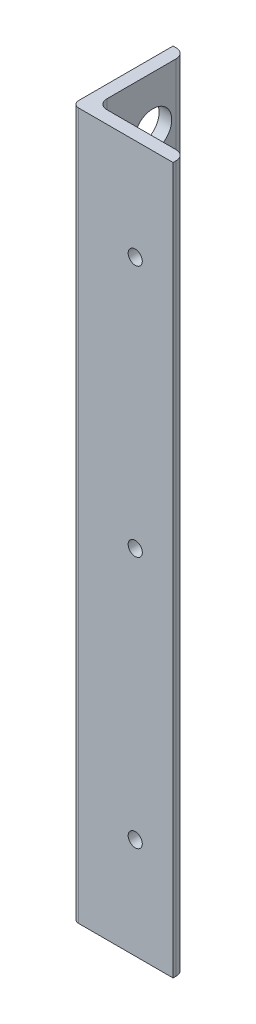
ISO-10303-21;
HEADER;
FILE_DESCRIPTION(('STEP AP214'),'2;1');
FILE_NAME('part.step','',(''),(''),'','','');
FILE_SCHEMA(('AUTOMOTIVE_DESIGN { 1 0 10303 214 1 1 1 1 }'));
ENDSEC;
DATA;
#1=APPLICATION_CONTEXT('core data for automotive mechanical design processes');
#2=APPLICATION_PROTOCOL_DEFINITION('international standard','automotive_design',2000,#1);
#3=PRODUCT_CONTEXT('',#1,'mechanical');
#4=PRODUCT('Part','Part','',(#3));
#5=PRODUCT_RELATED_PRODUCT_CATEGORY('part','',(#4));
#6=PRODUCT_DEFINITION_FORMATION('','',#4);
#7=PRODUCT_DEFINITION_CONTEXT('part definition',#1,'design');
#8=PRODUCT_DEFINITION('design','',#6,#7);
#9=PRODUCT_DEFINITION_SHAPE('','',#8);
#10=(LENGTH_UNIT() NAMED_UNIT(*) SI_UNIT(.MILLI.,.METRE.));
#11=(NAMED_UNIT(*) PLANE_ANGLE_UNIT() SI_UNIT($,.RADIAN.));
#12=(NAMED_UNIT(*) SI_UNIT($,.STERADIAN.) SOLID_ANGLE_UNIT());
#13=UNCERTAINTY_MEASURE_WITH_UNIT(LENGTH_MEASURE(1.E-05),#10,'distance_accuracy_value','');
#14=(GEOMETRIC_REPRESENTATION_CONTEXT(3) GLOBAL_UNCERTAINTY_ASSIGNED_CONTEXT((#13)) GLOBAL_UNIT_ASSIGNED_CONTEXT((#10,
#11,#12)) REPRESENTATION_CONTEXT('',''));
#15=CARTESIAN_POINT('',(0.,0.,0.));
#16=DIRECTION('',(0.,0.,1.));
#17=DIRECTION('',(1.,0.,0.));
#18=AXIS2_PLACEMENT_3D('',#15,#16,#17);
#19=CARTESIAN_POINT('',(25.4,177.8,0.));
#20=DIRECTION('',(0.,0.,-1.));
#21=DIRECTION('',(-1.,0.,0.));
#22=AXIS2_PLACEMENT_3D('',#19,#20,#21);
#23=PLANE('',#22);
#24=CARTESIAN_POINT('',(15.8749999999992,25.4000000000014,0.));
#25=DIRECTION('',(0.,0.,-1.));
#26=DIRECTION('',(-1.,0.,0.));
#27=AXIS2_PLACEMENT_3D('',#24,#25,#26);
#28=CIRCLE('',#27,1.77799999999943);
#29=CARTESIAN_POINT('',(14.0969999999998,25.4000000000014,0.));
#30=VERTEX_POINT('',#29);
#31=EDGE_CURVE('E255',#30,#30,#28,.T.);
#32=ORIENTED_EDGE('',*,*,#31,.T.);
#33=EDGE_LOOP('',(#32));
#34=FACE_BOUND('',#33,.T.);
#35=CARTESIAN_POINT('',(15.8749999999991,88.9000000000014,0.));
#36=DIRECTION('',(0.,0.,-1.));
#37=DIRECTION('',(-1.,0.,0.));
#38=AXIS2_PLACEMENT_3D('',#35,#36,#37);
#39=CIRCLE('',#38,1.7779999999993);
#40=CARTESIAN_POINT('',(14.0969999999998,88.9000000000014,0.));
#41=VERTEX_POINT('',#40);
#42=EDGE_CURVE('E269',#41,#41,#39,.T.);
#43=ORIENTED_EDGE('',*,*,#42,.T.);
#44=EDGE_LOOP('',(#43));
#45=FACE_BOUND('',#44,.T.);
#46=CARTESIAN_POINT('',(15.874999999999,152.400000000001,0.));
#47=DIRECTION('',(0.,0.,-1.));
#48=DIRECTION('',(-1.,0.,0.));
#49=AXIS2_PLACEMENT_3D('',#46,#47,#48);
#50=CIRCLE('',#49,1.77799999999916);
#51=CARTESIAN_POINT('',(14.0969999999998,152.400000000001,0.));
#52=VERTEX_POINT('',#51);
#53=EDGE_CURVE('E263',#52,#52,#50,.T.);
#54=ORIENTED_EDGE('',*,*,#53,.T.);
#55=EDGE_LOOP('',(#54));
#56=FACE_BOUND('',#55,.T.);
#57=DIRECTION('',(1.,0.,0.));
#58=VECTOR('',#57,1.);
#59=CARTESIAN_POINT('',(25.4,177.8,0.));
#60=LINE('',#59,#58);
#61=CARTESIAN_POINT('',(1.5875,177.8,0.));
#62=VERTEX_POINT('',#61);
#63=CARTESIAN_POINT('',(25.4,177.8,0.));
#64=VERTEX_POINT('',#63);
#65=EDGE_CURVE('E113',#62,#64,#60,.T.);
#66=ORIENTED_EDGE('',*,*,#65,.F.);
#67=DIRECTION('',(0.,-1.,0.));
#68=VECTOR('',#67,1.);
#69=CARTESIAN_POINT('',(1.5875,177.8,0.));
#70=LINE('',#69,#68);
#71=CARTESIAN_POINT('',(1.5875,0.,0.));
#72=VERTEX_POINT('',#71);
#73=EDGE_CURVE('E169',#62,#72,#70,.T.);
#74=ORIENTED_EDGE('',*,*,#73,.T.);
#75=DIRECTION('',(1.,0.,0.));
#76=VECTOR('',#75,1.);
#77=CARTESIAN_POINT('',(25.4,0.,0.));
#78=LINE('',#77,#76);
#79=CARTESIAN_POINT('',(25.4,0.,0.));
#80=VERTEX_POINT('',#79);
#81=EDGE_CURVE('E134',#72,#80,#78,.T.);
#82=ORIENTED_EDGE('',*,*,#81,.T.);
#83=DIRECTION('',(0.,-1.,0.));
#84=VECTOR('',#83,1.);
#85=CARTESIAN_POINT('',(25.4,177.8,0.));
#86=LINE('',#85,#84);
#87=EDGE_CURVE('E129',#64,#80,#86,.T.);
#88=ORIENTED_EDGE('',*,*,#87,.F.);
#89=EDGE_LOOP('',(#66,#74,#82,#88));
#90=FACE_BOUND('',#89,.T.);
#91=ADVANCED_FACE('F36',(#34,#45,#56,#90),#23,.F.);
#92=CARTESIAN_POINT('',(25.4,177.8,-3.175));
#93=DIRECTION('',(-1.,0.,0.));
#94=DIRECTION('',(0.,0.,1.));
#95=AXIS2_PLACEMENT_3D('',#92,#93,#94);
#96=PLANE('',#95);
#97=DIRECTION('',(0.,0.,-1.));
#98=VECTOR('',#97,1.);
#99=CARTESIAN_POINT('',(25.4,0.,-3.175));
#100=LINE('',#99,#98);
#101=CARTESIAN_POINT('',(25.4,0.,-0.79375));
#102=VERTEX_POINT('',#101);
#103=EDGE_CURVE('E173',#80,#102,#100,.T.);
#104=ORIENTED_EDGE('',*,*,#103,.T.);
#105=DIRECTION('',(0.,-1.,0.));
#106=VECTOR('',#105,1.);
#107=CARTESIAN_POINT('',(25.4,177.8,-0.79375));
#108=LINE('',#107,#106);
#109=CARTESIAN_POINT('',(25.4,177.8,-0.79375));
#110=VERTEX_POINT('',#109);
#111=EDGE_CURVE('E131',#102,#110,#108,.F.);
#112=ORIENTED_EDGE('',*,*,#111,.T.);
#113=DIRECTION('',(0.,0.,-1.));
#114=VECTOR('',#113,1.);
#115=CARTESIAN_POINT('',(25.4,177.8,-3.175));
#116=LINE('',#115,#114);
#117=EDGE_CURVE('E116',#64,#110,#116,.T.);
#118=ORIENTED_EDGE('',*,*,#117,.F.);
#119=ORIENTED_EDGE('',*,*,#87,.T.);
#120=EDGE_LOOP('',(#104,#112,#118,#119));
#121=FACE_BOUND('',#120,.T.);
#122=ADVANCED_FACE('F128',(#121),#96,.F.);
#123=CARTESIAN_POINT('',(3.175,177.8,-3.175));
#124=DIRECTION('',(0.,0.,1.));
#125=DIRECTION('',(1.,0.,0.));
#126=AXIS2_PLACEMENT_3D('',#123,#124,#125);
#127=PLANE('',#126);
#128=CARTESIAN_POINT('',(15.8749999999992,25.4000000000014,-3.175));
#129=DIRECTION('',(0.,0.,-1.));
#130=DIRECTION('',(-1.,0.,0.));
#131=AXIS2_PLACEMENT_3D('',#128,#129,#130);
#132=CIRCLE('',#131,1.77799999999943);
#133=CARTESIAN_POINT('',(14.0969999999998,25.4000000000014,-3.175));
#134=VERTEX_POINT('',#133);
#135=EDGE_CURVE('E272',#134,#134,#132,.T.);
#136=ORIENTED_EDGE('',*,*,#135,.F.);
#137=EDGE_LOOP('',(#136));
#138=FACE_BOUND('',#137,.T.);
#139=CARTESIAN_POINT('',(15.8749999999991,88.9000000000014,-3.175));
#140=DIRECTION('',(0.,0.,-1.));
#141=DIRECTION('',(-1.,0.,0.));
#142=AXIS2_PLACEMENT_3D('',#139,#140,#141);
#143=CIRCLE('',#142,1.7779999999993);
#144=CARTESIAN_POINT('',(14.0969999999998,88.9000000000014,-3.175));
#145=VERTEX_POINT('',#144);
#146=EDGE_CURVE('E266',#145,#145,#143,.T.);
#147=ORIENTED_EDGE('',*,*,#146,.F.);
#148=EDGE_LOOP('',(#147));
#149=FACE_BOUND('',#148,.T.);
#150=CARTESIAN_POINT('',(15.874999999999,152.400000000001,-3.175));
#151=DIRECTION('',(0.,0.,-1.));
#152=DIRECTION('',(-1.,0.,0.));
#153=AXIS2_PLACEMENT_3D('',#150,#151,#152);
#154=CIRCLE('',#153,1.77799999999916);
#155=CARTESIAN_POINT('',(14.0969999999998,152.400000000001,-3.175));
#156=VERTEX_POINT('',#155);
#157=EDGE_CURVE('E260',#156,#156,#154,.T.);
#158=ORIENTED_EDGE('',*,*,#157,.F.);
#159=EDGE_LOOP('',(#158));
#160=FACE_BOUND('',#159,.T.);
#161=DIRECTION('',(-1.,0.,0.));
#162=VECTOR('',#161,1.);
#163=CARTESIAN_POINT('',(3.175,0.,-3.175));
#164=LINE('',#163,#162);
#165=CARTESIAN_POINT('',(23.01875,0.,-3.175));
#166=VERTEX_POINT('',#165);
#167=CARTESIAN_POINT('',(5.55625,0.,-3.175));
#168=VERTEX_POINT('',#167);
#169=EDGE_CURVE('E176',#166,#168,#164,.T.);
#170=ORIENTED_EDGE('',*,*,#169,.T.);
#171=DIRECTION('',(0.,-1.,0.));
#172=VECTOR('',#171,1.);
#173=CARTESIAN_POINT('',(5.55625,177.8,-3.175));
#174=LINE('',#173,#172);
#175=CARTESIAN_POINT('',(5.55625,177.8,-3.175));
#176=VERTEX_POINT('',#175);
#177=EDGE_CURVE('E151',#168,#176,#174,.F.);
#178=ORIENTED_EDGE('',*,*,#177,.T.);
#179=DIRECTION('',(-1.,0.,0.));
#180=VECTOR('',#179,1.);
#181=CARTESIAN_POINT('',(3.175,177.8,-3.175));
#182=LINE('',#181,#180);
#183=CARTESIAN_POINT('',(23.01875,177.8,-3.175));
#184=VERTEX_POINT('',#183);
#185=EDGE_CURVE('E132',#184,#176,#182,.T.);
#186=ORIENTED_EDGE('',*,*,#185,.F.);
#187=DIRECTION('',(0.,-1.,0.));
#188=VECTOR('',#187,1.);
#189=CARTESIAN_POINT('',(23.01875,177.8,-3.175));
#190=LINE('',#189,#188);
#191=EDGE_CURVE('E148',#184,#166,#190,.T.);
#192=ORIENTED_EDGE('',*,*,#191,.T.);
#193=EDGE_LOOP('',(#170,#178,#186,#192));
#194=FACE_BOUND('',#193,.T.);
#195=ADVANCED_FACE('F211',(#138,#149,#160,#194),#127,.F.);
#196=CARTESIAN_POINT('',(3.175,177.8,-25.4));
#197=DIRECTION('',(-1.,0.,0.));
#198=DIRECTION('',(0.,0.,1.));
#199=AXIS2_PLACEMENT_3D('',#196,#197,#198);
#200=PLANE('',#199);
#201=CARTESIAN_POINT('',(3.175,165.1,-17.145));
#202=DIRECTION('',(1.,0.,0.));
#203=DIRECTION('',(0.,0.,-1.));
#204=AXIS2_PLACEMENT_3D('',#201,#202,#203);
#205=CIRCLE('',#204,4.7371);
#206=CARTESIAN_POINT('',(3.175,165.1,-21.8821));
#207=VERTEX_POINT('',#206);
#208=EDGE_CURVE('E179',#207,#207,#205,.T.);
#209=ORIENTED_EDGE('',*,*,#208,.F.);
#210=EDGE_LOOP('',(#209));
#211=FACE_BOUND('',#210,.T.);
#212=CARTESIAN_POINT('',(3.175,63.5,-17.145));
#213=DIRECTION('',(1.,0.,0.));
#214=DIRECTION('',(0.,0.,-1.));
#215=AXIS2_PLACEMENT_3D('',#212,#213,#214);
#216=CIRCLE('',#215,4.7371);
#217=CARTESIAN_POINT('',(3.175,63.5,-21.8821));
#218=VERTEX_POINT('',#217);
#219=EDGE_CURVE('E252',#218,#218,#216,.T.);
#220=ORIENTED_EDGE('',*,*,#219,.F.);
#221=EDGE_LOOP('',(#220));
#222=FACE_BOUND('',#221,.T.);
#223=CARTESIAN_POINT('',(3.175,12.7,-17.145));
#224=DIRECTION('',(1.,0.,0.));
#225=DIRECTION('',(0.,0.,-1.));
#226=AXIS2_PLACEMENT_3D('',#223,#224,#225);
#227=CIRCLE('',#226,4.7371);
#228=CARTESIAN_POINT('',(3.175,12.7,-21.8821));
#229=VERTEX_POINT('',#228);
#230=EDGE_CURVE('E239',#229,#229,#227,.T.);
#231=ORIENTED_EDGE('',*,*,#230,.F.);
#232=EDGE_LOOP('',(#231));
#233=FACE_BOUND('',#232,.T.);
#234=CARTESIAN_POINT('',(3.175,114.3,-17.145));
#235=DIRECTION('',(1.,0.,0.));
#236=DIRECTION('',(0.,0.,-1.));
#237=AXIS2_PLACEMENT_3D('',#234,#235,#236);
#238=CIRCLE('',#237,4.7371);
#239=CARTESIAN_POINT('',(3.175,114.3,-21.8821));
#240=VERTEX_POINT('',#239);
#241=EDGE_CURVE('E246',#240,#240,#238,.T.);
#242=ORIENTED_EDGE('',*,*,#241,.F.);
#243=EDGE_LOOP('',(#242));
#244=FACE_BOUND('',#243,.T.);
#245=DIRECTION('',(0.,0.,-1.));
#246=VECTOR('',#245,1.);
#247=CARTESIAN_POINT('',(3.175,177.8,-25.4));
#248=LINE('',#247,#246);
#249=CARTESIAN_POINT('',(3.175,177.8,-5.55625));
#250=VERTEX_POINT('',#249);
#251=CARTESIAN_POINT('',(3.175,177.8,-23.01875));
#252=VERTEX_POINT('',#251);
#253=EDGE_CURVE('E232',#250,#252,#248,.T.);
#254=ORIENTED_EDGE('',*,*,#253,.F.);
#255=DIRECTION('',(0.,-1.,0.));
#256=VECTOR('',#255,1.);
#257=CARTESIAN_POINT('',(3.175,0.,-5.55625));
#258=LINE('',#257,#256);
#259=CARTESIAN_POINT('',(3.175,0.,-5.55625));
#260=VERTEX_POINT('',#259);
#261=EDGE_CURVE('E139',#250,#260,#258,.T.);
#262=ORIENTED_EDGE('',*,*,#261,.T.);
#263=DIRECTION('',(0.,0.,-1.));
#264=VECTOR('',#263,1.);
#265=CARTESIAN_POINT('',(3.175,0.,-25.4));
#266=LINE('',#265,#264);
#267=CARTESIAN_POINT('',(3.175,0.,-23.01875));
#268=VERTEX_POINT('',#267);
#269=EDGE_CURVE('E186',#260,#268,#266,.T.);
#270=ORIENTED_EDGE('',*,*,#269,.T.);
#271=DIRECTION('',(0.,-1.,0.));
#272=VECTOR('',#271,1.);
#273=CARTESIAN_POINT('',(3.175,177.8,-23.01875));
#274=LINE('',#273,#272);
#275=EDGE_CURVE('E136',#268,#252,#274,.F.);
#276=ORIENTED_EDGE('',*,*,#275,.T.);
#277=EDGE_LOOP('',(#254,#262,#270,#276));
#278=FACE_BOUND('',#277,.T.);
#279=ADVANCED_FACE('F286',(#211,#222,#233,#244,#278),#200,.F.);
#280=CARTESIAN_POINT('',(0.,177.8,-25.4));
#281=DIRECTION('',(0.,0.,1.));
#282=DIRECTION('',(1.,0.,0.));
#283=AXIS2_PLACEMENT_3D('',#280,#281,#282);
#284=PLANE('',#283);
#285=DIRECTION('',(-1.,0.,0.));
#286=VECTOR('',#285,1.);
#287=CARTESIAN_POINT('',(0.,177.8,-25.4));
#288=LINE('',#287,#286);
#289=CARTESIAN_POINT('',(0.79375,177.8,-25.4));
#290=VERTEX_POINT('',#289);
#291=CARTESIAN_POINT('',(0.,177.8,-25.4));
#292=VERTEX_POINT('',#291);
#293=EDGE_CURVE('E230',#290,#292,#288,.T.);
#294=ORIENTED_EDGE('',*,*,#293,.F.);
#295=DIRECTION('',(0.,-1.,0.));
#296=VECTOR('',#295,1.);
#297=CARTESIAN_POINT('',(0.79375,177.8,-25.4));
#298=LINE('',#297,#296);
#299=CARTESIAN_POINT('',(0.79375,0.,-25.4));
#300=VERTEX_POINT('',#299);
#301=EDGE_CURVE('E153',#290,#300,#298,.T.);
#302=ORIENTED_EDGE('',*,*,#301,.T.);
#303=DIRECTION('',(-1.,0.,0.));
#304=VECTOR('',#303,1.);
#305=CARTESIAN_POINT('',(0.,0.,-25.4));
#306=LINE('',#305,#304);
#307=CARTESIAN_POINT('',(0.,0.,-25.4));
#308=VERTEX_POINT('',#307);
#309=EDGE_CURVE('E189',#300,#308,#306,.T.);
#310=ORIENTED_EDGE('',*,*,#309,.T.);
#311=DIRECTION('',(0.,-1.,0.));
#312=VECTOR('',#311,1.);
#313=CARTESIAN_POINT('',(0.,177.8,-25.4));
#314=LINE('',#313,#312);
#315=EDGE_CURVE('E137',#292,#308,#314,.T.);
#316=ORIENTED_EDGE('',*,*,#315,.F.);
#317=EDGE_LOOP('',(#294,#302,#310,#316));
#318=FACE_BOUND('',#317,.T.);
#319=ADVANCED_FACE('F234',(#318),#284,.F.);
#320=CARTESIAN_POINT('',(0.,177.8,0.));
#321=DIRECTION('',(1.,0.,0.));
#322=DIRECTION('',(0.,0.,-1.));
#323=AXIS2_PLACEMENT_3D('',#320,#321,#322);
#324=PLANE('',#323);
#325=CARTESIAN_POINT('',(0.,165.1,-17.145));
#326=DIRECTION('',(1.,0.,0.));
#327=DIRECTION('',(0.,0.,-1.));
#328=AXIS2_PLACEMENT_3D('',#325,#326,#327);
#329=CIRCLE('',#328,4.7371);
#330=CARTESIAN_POINT('',(0.,165.1,-21.8821));
#331=VERTEX_POINT('',#330);
#332=EDGE_CURVE('E174',#331,#331,#329,.T.);
#333=ORIENTED_EDGE('',*,*,#332,.T.);
#334=EDGE_LOOP('',(#333));
#335=FACE_BOUND('',#334,.T.);
#336=CARTESIAN_POINT('',(0.,63.5,-17.145));
#337=DIRECTION('',(1.,0.,0.));
#338=DIRECTION('',(0.,0.,-1.));
#339=AXIS2_PLACEMENT_3D('',#336,#337,#338);
#340=CIRCLE('',#339,4.7371);
#341=CARTESIAN_POINT('',(0.,63.5,-21.8821));
#342=VERTEX_POINT('',#341);
#343=EDGE_CURVE('E243',#342,#342,#340,.T.);
#344=ORIENTED_EDGE('',*,*,#343,.T.);
#345=EDGE_LOOP('',(#344));
#346=FACE_BOUND('',#345,.T.);
#347=CARTESIAN_POINT('',(0.,12.7,-17.145));
#348=DIRECTION('',(1.,0.,0.));
#349=DIRECTION('',(0.,0.,-1.));
#350=AXIS2_PLACEMENT_3D('',#347,#348,#349);
#351=CIRCLE('',#350,4.7371);
#352=CARTESIAN_POINT('',(0.,12.7,-21.8821));
#353=VERTEX_POINT('',#352);
#354=EDGE_CURVE('E242',#353,#353,#351,.T.);
#355=ORIENTED_EDGE('',*,*,#354,.T.);
#356=EDGE_LOOP('',(#355));
#357=FACE_BOUND('',#356,.T.);
#358=CARTESIAN_POINT('',(0.,114.3,-17.145));
#359=DIRECTION('',(1.,0.,0.));
#360=DIRECTION('',(0.,0.,-1.));
#361=AXIS2_PLACEMENT_3D('',#358,#359,#360);
#362=CIRCLE('',#361,4.7371);
#363=CARTESIAN_POINT('',(0.,114.3,-21.8821));
#364=VERTEX_POINT('',#363);
#365=EDGE_CURVE('E249',#364,#364,#362,.T.);
#366=ORIENTED_EDGE('',*,*,#365,.T.);
#367=EDGE_LOOP('',(#366));
#368=FACE_BOUND('',#367,.T.);
#369=DIRECTION('',(0.,0.,1.));
#370=VECTOR('',#369,1.);
#371=CARTESIAN_POINT('',(0.,0.,0.));
#372=LINE('',#371,#370);
#373=CARTESIAN_POINT('',(0.,0.,-1.5875));
#374=VERTEX_POINT('',#373);
#375=EDGE_CURVE('E123',#308,#374,#372,.T.);
#376=ORIENTED_EDGE('',*,*,#375,.T.);
#377=DIRECTION('',(0.,-1.,0.));
#378=VECTOR('',#377,1.);
#379=CARTESIAN_POINT('',(0.,177.8,-1.5875));
#380=LINE('',#379,#378);
#381=CARTESIAN_POINT('',(0.,177.8,-1.5875));
#382=VERTEX_POINT('',#381);
#383=EDGE_CURVE('E44',#374,#382,#380,.F.);
#384=ORIENTED_EDGE('',*,*,#383,.T.);
#385=DIRECTION('',(0.,0.,1.));
#386=VECTOR('',#385,1.);
#387=CARTESIAN_POINT('',(0.,177.8,0.));
#388=LINE('',#387,#386);
#389=EDGE_CURVE('E142',#292,#382,#388,.T.);
#390=ORIENTED_EDGE('',*,*,#389,.F.);
#391=ORIENTED_EDGE('',*,*,#315,.T.);
#392=EDGE_LOOP('',(#376,#384,#390,#391));
#393=FACE_BOUND('',#392,.T.);
#394=ADVANCED_FACE('F190',(#335,#346,#357,#368,#393),#324,.F.);
#395=CARTESIAN_POINT('',(0.,177.8,0.));
#396=DIRECTION('',(0.,-1.,0.));
#397=DIRECTION('',(0.,0.,-1.));
#398=AXIS2_PLACEMENT_3D('',#395,#396,#397);
#399=PLANE('',#398);
#400=ORIENTED_EDGE('',*,*,#389,.T.);
#401=CARTESIAN_POINT('',(1.5875,177.8,-1.5875));
#402=DIRECTION('',(0.,-1.,0.));
#403=DIRECTION('',(0.,0.,-1.));
#404=AXIS2_PLACEMENT_3D('',#401,#402,#403);
#405=CIRCLE('',#404,1.5875);
#406=EDGE_CURVE('E11',#382,#62,#405,.F.);
#407=ORIENTED_EDGE('',*,*,#406,.T.);
#408=ORIENTED_EDGE('',*,*,#65,.T.);
#409=ORIENTED_EDGE('',*,*,#117,.T.);
#410=CARTESIAN_POINT('',(23.01875,177.8,-0.79375));
#411=DIRECTION('',(0.,-1.,0.));
#412=DIRECTION('',(0.,0.,-1.));
#413=AXIS2_PLACEMENT_3D('',#410,#411,#412);
#414=CIRCLE('',#413,2.38125);
#415=EDGE_CURVE('E160',#110,#184,#414,.F.);
#416=ORIENTED_EDGE('',*,*,#415,.T.);
#417=ORIENTED_EDGE('',*,*,#185,.T.);
#418=CARTESIAN_POINT('',(5.55625,177.8,-5.55625));
#419=DIRECTION('',(0.,-1.,0.));
#420=DIRECTION('',(0.,0.,-1.));
#421=AXIS2_PLACEMENT_3D('',#418,#419,#420);
#422=CIRCLE('',#421,2.38125);
#423=EDGE_CURVE('E167',#176,#250,#422,.T.);
#424=ORIENTED_EDGE('',*,*,#423,.T.);
#425=ORIENTED_EDGE('',*,*,#253,.T.);
#426=CARTESIAN_POINT('',(0.79375,177.8,-23.01875));
#427=DIRECTION('',(0.,-1.,0.));
#428=DIRECTION('',(0.,0.,-1.));
#429=AXIS2_PLACEMENT_3D('',#426,#427,#428);
#430=CIRCLE('',#429,2.38125);
#431=EDGE_CURVE('E162',#252,#290,#430,.F.);
#432=ORIENTED_EDGE('',*,*,#431,.T.);
#433=ORIENTED_EDGE('',*,*,#293,.T.);
#434=EDGE_LOOP('',(#400,#407,#408,#409,#416,#417,#424,#425,#432,#433));
#435=FACE_BOUND('',#434,.T.);
#436=ADVANCED_FACE('F115',(#435),#399,.F.);
#437=CARTESIAN_POINT('',(0.,0.,0.));
#438=DIRECTION('',(0.,-1.,0.));
#439=DIRECTION('',(0.,0.,-1.));
#440=AXIS2_PLACEMENT_3D('',#437,#438,#439);
#441=PLANE('',#440);
#442=ORIENTED_EDGE('',*,*,#81,.F.);
#443=CARTESIAN_POINT('',(1.5875,0.,-1.5875));
#444=DIRECTION('',(0.,-1.,0.));
#445=DIRECTION('',(0.,0.,-1.));
#446=AXIS2_PLACEMENT_3D('',#443,#444,#445);
#447=CIRCLE('',#446,1.5875);
#448=EDGE_CURVE('E58',#72,#374,#447,.T.);
#449=ORIENTED_EDGE('',*,*,#448,.T.);
#450=ORIENTED_EDGE('',*,*,#375,.F.);
#451=ORIENTED_EDGE('',*,*,#309,.F.);
#452=CARTESIAN_POINT('',(0.79375,0.,-23.01875));
#453=DIRECTION('',(0.,-1.,0.));
#454=DIRECTION('',(0.,0.,-1.));
#455=AXIS2_PLACEMENT_3D('',#452,#453,#454);
#456=CIRCLE('',#455,2.38125);
#457=EDGE_CURVE('E158',#300,#268,#456,.T.);
#458=ORIENTED_EDGE('',*,*,#457,.T.);
#459=ORIENTED_EDGE('',*,*,#269,.F.);
#460=CARTESIAN_POINT('',(5.55625,0.,-5.55625));
#461=DIRECTION('',(0.,-1.,0.));
#462=DIRECTION('',(0.,0.,-1.));
#463=AXIS2_PLACEMENT_3D('',#460,#461,#462);
#464=CIRCLE('',#463,2.38125);
#465=EDGE_CURVE('E165',#260,#168,#464,.F.);
#466=ORIENTED_EDGE('',*,*,#465,.T.);
#467=ORIENTED_EDGE('',*,*,#169,.F.);
#468=CARTESIAN_POINT('',(23.01875,0.,-0.79375));
#469=DIRECTION('',(0.,-1.,0.));
#470=DIRECTION('',(0.,0.,-1.));
#471=AXIS2_PLACEMENT_3D('',#468,#469,#470);
#472=CIRCLE('',#471,2.38125);
#473=EDGE_CURVE('E156',#166,#102,#472,.T.);
#474=ORIENTED_EDGE('',*,*,#473,.T.);
#475=ORIENTED_EDGE('',*,*,#103,.F.);
#476=EDGE_LOOP('',(#442,#449,#450,#451,#458,#459,#466,#467,#474,#475));
#477=FACE_BOUND('',#476,.T.);
#478=ADVANCED_FACE('F172',(#477),#441,.T.);
#479=CARTESIAN_POINT('',(5.55625,177.8,-5.55625));
#480=DIRECTION('',(0.,1.,0.));
#481=DIRECTION('',(0.,0.,1.));
#482=AXIS2_PLACEMENT_3D('',#479,#480,#481);
#483=CYLINDRICAL_SURFACE('',#482,2.38125);
#484=ORIENTED_EDGE('',*,*,#423,.F.);
#485=ORIENTED_EDGE('',*,*,#177,.F.);
#486=ORIENTED_EDGE('',*,*,#465,.F.);
#487=ORIENTED_EDGE('',*,*,#261,.F.);
#488=EDGE_LOOP('',(#484,#485,#486,#487));
#489=FACE_BOUND('',#488,.T.);
#490=ADVANCED_FACE('F217',(#489),#483,.F.);
#491=CARTESIAN_POINT('',(0.79375,177.8,-23.01875));
#492=DIRECTION('',(0.,-1.,0.));
#493=DIRECTION('',(0.,0.,-1.));
#494=AXIS2_PLACEMENT_3D('',#491,#492,#493);
#495=CYLINDRICAL_SURFACE('',#494,2.38125);
#496=ORIENTED_EDGE('',*,*,#431,.F.);
#497=ORIENTED_EDGE('',*,*,#275,.F.);
#498=ORIENTED_EDGE('',*,*,#457,.F.);
#499=ORIENTED_EDGE('',*,*,#301,.F.);
#500=EDGE_LOOP('',(#496,#497,#498,#499));
#501=FACE_BOUND('',#500,.T.);
#502=ADVANCED_FACE('F203',(#501),#495,.T.);
#503=CARTESIAN_POINT('',(23.01875,177.8,-0.79375));
#504=DIRECTION('',(0.,-1.,0.));
#505=DIRECTION('',(0.,0.,-1.));
#506=AXIS2_PLACEMENT_3D('',#503,#504,#505);
#507=CYLINDRICAL_SURFACE('',#506,2.38125);
#508=ORIENTED_EDGE('',*,*,#415,.F.);
#509=ORIENTED_EDGE('',*,*,#111,.F.);
#510=ORIENTED_EDGE('',*,*,#473,.F.);
#511=ORIENTED_EDGE('',*,*,#191,.F.);
#512=EDGE_LOOP('',(#508,#509,#510,#511));
#513=FACE_BOUND('',#512,.T.);
#514=ADVANCED_FACE('F195',(#513),#507,.T.);
#515=CARTESIAN_POINT('',(1.5875,177.8,-1.5875));
#516=DIRECTION('',(0.,-1.,0.));
#517=DIRECTION('',(0.,0.,-1.));
#518=AXIS2_PLACEMENT_3D('',#515,#516,#517);
#519=CYLINDRICAL_SURFACE('',#518,1.5875);
#520=ORIENTED_EDGE('',*,*,#406,.F.);
#521=ORIENTED_EDGE('',*,*,#383,.F.);
#522=ORIENTED_EDGE('',*,*,#448,.F.);
#523=ORIENTED_EDGE('',*,*,#73,.F.);
#524=EDGE_LOOP('',(#520,#521,#522,#523));
#525=FACE_BOUND('',#524,.T.);
#526=ADVANCED_FACE('F38',(#525),#519,.T.);
#527=CARTESIAN_POINT('',(0.,114.3,-17.145));
#528=DIRECTION('',(1.,0.,0.));
#529=DIRECTION('',(0.,0.,-1.));
#530=AXIS2_PLACEMENT_3D('',#527,#528,#529);
#531=CYLINDRICAL_SURFACE('',#530,4.7371);
#532=CARTESIAN_POINT('',(0.,114.3,-21.8821));
#533=CARTESIAN_POINT('',(0.0330729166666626,114.3,-21.8821));
#534=CARTESIAN_POINT('',(0.0661458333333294,114.3,-21.8821));
#535=CARTESIAN_POINT('',(0.132291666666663,114.3,-21.8821));
#536=CARTESIAN_POINT('',(0.16536458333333,114.3,-21.8821));
#537=CARTESIAN_POINT('',(0.231510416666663,114.3,-21.8821));
#538=CARTESIAN_POINT('',(0.26458333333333,114.3,-21.8821));
#539=CARTESIAN_POINT('',(0.330729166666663,114.3,-21.8821));
#540=CARTESIAN_POINT('',(0.36380208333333,114.3,-21.8821));
#541=CARTESIAN_POINT('',(0.429947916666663,114.3,-21.8821));
#542=CARTESIAN_POINT('',(0.46302083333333,114.3,-21.8821));
#543=CARTESIAN_POINT('',(0.529166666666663,114.3,-21.8821));
#544=CARTESIAN_POINT('',(0.56223958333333,114.3,-21.8821));
#545=CARTESIAN_POINT('',(0.628385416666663,114.3,-21.8821));
#546=CARTESIAN_POINT('',(0.66145833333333,114.3,-21.8821));
#547=CARTESIAN_POINT('',(0.727604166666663,114.3,-21.8821));
#548=CARTESIAN_POINT('',(0.76067708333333,114.3,-21.8821));
#549=CARTESIAN_POINT('',(0.826822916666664,114.3,-21.8821));
#550=CARTESIAN_POINT('',(0.85989583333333,114.3,-21.8821));
#551=CARTESIAN_POINT('',(0.926041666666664,114.3,-21.8821));
#552=CARTESIAN_POINT('',(0.95911458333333,114.3,-21.8821));
#553=CARTESIAN_POINT('',(1.02526041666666,114.3,-21.8821));
#554=CARTESIAN_POINT('',(1.05833333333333,114.3,-21.8821));
#555=CARTESIAN_POINT('',(1.12447916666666,114.3,-21.8821));
#556=CARTESIAN_POINT('',(1.15755208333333,114.3,-21.8821));
#557=CARTESIAN_POINT('',(1.22369791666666,114.3,-21.8821));
#558=CARTESIAN_POINT('',(1.25677083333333,114.3,-21.8821));
#559=CARTESIAN_POINT('',(1.32291666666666,114.3,-21.8821));
#560=CARTESIAN_POINT('',(1.35598958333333,114.3,-21.8821));
#561=CARTESIAN_POINT('',(1.42213541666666,114.3,-21.8821));
#562=CARTESIAN_POINT('',(1.45520833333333,114.3,-21.8821));
#563=CARTESIAN_POINT('',(1.52135416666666,114.3,-21.8821));
#564=CARTESIAN_POINT('',(1.55442708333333,114.3,-21.8821));
#565=CARTESIAN_POINT('',(1.62057291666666,114.3,-21.8821));
#566=CARTESIAN_POINT('',(1.65364583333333,114.3,-21.8821));
#567=CARTESIAN_POINT('',(1.71979166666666,114.3,-21.8821));
#568=CARTESIAN_POINT('',(1.75286458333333,114.3,-21.8821));
#569=CARTESIAN_POINT('',(1.81901041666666,114.3,-21.8821));
#570=CARTESIAN_POINT('',(1.85208333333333,114.3,-21.8821));
#571=CARTESIAN_POINT('',(1.91822916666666,114.3,-21.8821));
#572=CARTESIAN_POINT('',(1.95130208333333,114.3,-21.8821));
#573=CARTESIAN_POINT('',(2.01744791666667,114.3,-21.8821));
#574=CARTESIAN_POINT('',(2.05052083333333,114.3,-21.8821));
#575=CARTESIAN_POINT('',(2.11666666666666,114.3,-21.8821));
#576=CARTESIAN_POINT('',(2.14973958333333,114.3,-21.8821));
#577=CARTESIAN_POINT('',(2.21588541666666,114.3,-21.8821));
#578=CARTESIAN_POINT('',(2.24895833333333,114.3,-21.8821));
#579=CARTESIAN_POINT('',(2.31510416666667,114.3,-21.8821));
#580=CARTESIAN_POINT('',(2.34817708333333,114.3,-21.8821));
#581=CARTESIAN_POINT('',(2.41432291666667,114.3,-21.8821));
#582=CARTESIAN_POINT('',(2.44739583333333,114.3,-21.8821));
#583=CARTESIAN_POINT('',(2.51354166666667,114.3,-21.8821));
#584=CARTESIAN_POINT('',(2.54661458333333,114.3,-21.8821));
#585=CARTESIAN_POINT('',(2.61276041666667,114.3,-21.8821));
#586=CARTESIAN_POINT('',(2.64583333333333,114.3,-21.8821));
#587=CARTESIAN_POINT('',(2.71197916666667,114.3,-21.8821));
#588=CARTESIAN_POINT('',(2.74505208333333,114.3,-21.8821));
#589=CARTESIAN_POINT('',(2.81119791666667,114.3,-21.8821));
#590=CARTESIAN_POINT('',(2.84427083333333,114.3,-21.8821));
#591=CARTESIAN_POINT('',(2.91041666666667,114.3,-21.8821));
#592=CARTESIAN_POINT('',(2.94348958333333,114.3,-21.8821));
#593=CARTESIAN_POINT('',(3.00963541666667,114.3,-21.8821));
#594=CARTESIAN_POINT('',(3.04270833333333,114.3,-21.8821));
#595=CARTESIAN_POINT('',(3.10885416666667,114.3,-21.8821));
#596=CARTESIAN_POINT('',(3.14192708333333,114.3,-21.8821));
#597=CARTESIAN_POINT('',(3.175,114.3,-21.8821));
#598=B_SPLINE_CURVE_WITH_KNOTS('',3,(#532,#533,#534,#535,#536,#537,#538,#539,#540,#541,#542,
#543,#544,#545,#546,#547,#548,#549,#550,#551,#552,#553,#554,#555,#556,#557,#558,#559,#560,#561,
#562,#563,#564,#565,#566,#567,#568,#569,#570,#571,#572,#573,#574,#575,#576,#577,#578,#579,#580,
#581,#582,#583,#584,#585,#586,#587,#588,#589,#590,#591,#592,#593,#594,#595,#596,#597),
.UNSPECIFIED.,.F.,.F.,(4,2,2,2,2,2,2,2,2,2,2,2,2,2,2,2,2,2,2,2,2,2,2,2,2,2,2,2,2,2,2,2,4),(0.,
0.0992187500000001,0.1984375,0.29765625,0.396875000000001,0.496093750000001,0.595312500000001,
0.694531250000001,0.793750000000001,0.892968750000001,0.992187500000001,1.09140625,1.190625,
1.28984375,1.3890625,1.48828125,1.5875,1.68671875,1.7859375,1.88515625,1.984375,2.08359375,
2.1828125,2.28203125,2.38125,2.48046875,2.5796875,2.67890625,2.778125,2.87734375,2.9765625,
3.07578125,3.175),.UNSPECIFIED.);
#599=EDGE_CURVE('BSEAM194',#364,#240,#598,.T.);
#600=ORIENTED_EDGE('',*,*,#365,.F.);
#601=ORIENTED_EDGE('',*,*,#241,.T.);
#602=ORIENTED_EDGE('',*,*,#599,.T.);
#603=ORIENTED_EDGE('',*,*,#599,.F.);
#604=EDGE_LOOP('',(#600,#602,#601,#603));
#605=FACE_BOUND('',#604,.T.);
#606=ADVANCED_FACE('F194',(#605),#531,.F.);
#607=CARTESIAN_POINT('',(0.,12.7,-17.145));
#608=DIRECTION('',(1.,0.,0.));
#609=DIRECTION('',(0.,0.,-1.));
#610=AXIS2_PLACEMENT_3D('',#607,#608,#609);
#611=CYLINDRICAL_SURFACE('',#610,4.7371);
#612=CARTESIAN_POINT('',(0.,12.7,-21.8821));
#613=CARTESIAN_POINT('',(0.0330729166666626,12.7,-21.8821));
#614=CARTESIAN_POINT('',(0.0661458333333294,12.7,-21.8821));
#615=CARTESIAN_POINT('',(0.132291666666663,12.7,-21.8821));
#616=CARTESIAN_POINT('',(0.16536458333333,12.7,-21.8821));
#617=CARTESIAN_POINT('',(0.231510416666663,12.7,-21.8821));
#618=CARTESIAN_POINT('',(0.26458333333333,12.7,-21.8821));
#619=CARTESIAN_POINT('',(0.330729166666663,12.7,-21.8821));
#620=CARTESIAN_POINT('',(0.36380208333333,12.7,-21.8821));
#621=CARTESIAN_POINT('',(0.429947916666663,12.7,-21.8821));
#622=CARTESIAN_POINT('',(0.46302083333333,12.7,-21.8821));
#623=CARTESIAN_POINT('',(0.529166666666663,12.7,-21.8821));
#624=CARTESIAN_POINT('',(0.56223958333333,12.7,-21.8821));
#625=CARTESIAN_POINT('',(0.628385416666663,12.7,-21.8821));
#626=CARTESIAN_POINT('',(0.66145833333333,12.7,-21.8821));
#627=CARTESIAN_POINT('',(0.727604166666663,12.7,-21.8821));
#628=CARTESIAN_POINT('',(0.76067708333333,12.7,-21.8821));
#629=CARTESIAN_POINT('',(0.826822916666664,12.7,-21.8821));
#630=CARTESIAN_POINT('',(0.85989583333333,12.7,-21.8821));
#631=CARTESIAN_POINT('',(0.926041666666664,12.7,-21.8821));
#632=CARTESIAN_POINT('',(0.95911458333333,12.7,-21.8821));
#633=CARTESIAN_POINT('',(1.02526041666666,12.7,-21.8821));
#634=CARTESIAN_POINT('',(1.05833333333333,12.7,-21.8821));
#635=CARTESIAN_POINT('',(1.12447916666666,12.7,-21.8821));
#636=CARTESIAN_POINT('',(1.15755208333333,12.7,-21.8821));
#637=CARTESIAN_POINT('',(1.22369791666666,12.7,-21.8821));
#638=CARTESIAN_POINT('',(1.25677083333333,12.7,-21.8821));
#639=CARTESIAN_POINT('',(1.32291666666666,12.7,-21.8821));
#640=CARTESIAN_POINT('',(1.35598958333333,12.7,-21.8821));
#641=CARTESIAN_POINT('',(1.42213541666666,12.7,-21.8821));
#642=CARTESIAN_POINT('',(1.45520833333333,12.7,-21.8821));
#643=CARTESIAN_POINT('',(1.52135416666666,12.7,-21.8821));
#644=CARTESIAN_POINT('',(1.55442708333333,12.7,-21.8821));
#645=CARTESIAN_POINT('',(1.62057291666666,12.7,-21.8821));
#646=CARTESIAN_POINT('',(1.65364583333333,12.7,-21.8821));
#647=CARTESIAN_POINT('',(1.71979166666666,12.7,-21.8821));
#648=CARTESIAN_POINT('',(1.75286458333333,12.7,-21.8821));
#649=CARTESIAN_POINT('',(1.81901041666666,12.7,-21.8821));
#650=CARTESIAN_POINT('',(1.85208333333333,12.7,-21.8821));
#651=CARTESIAN_POINT('',(1.91822916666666,12.7,-21.8821));
#652=CARTESIAN_POINT('',(1.95130208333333,12.7,-21.8821));
#653=CARTESIAN_POINT('',(2.01744791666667,12.7,-21.8821));
#654=CARTESIAN_POINT('',(2.05052083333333,12.7,-21.8821));
#655=CARTESIAN_POINT('',(2.11666666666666,12.7,-21.8821));
#656=CARTESIAN_POINT('',(2.14973958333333,12.7,-21.8821));
#657=CARTESIAN_POINT('',(2.21588541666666,12.7,-21.8821));
#658=CARTESIAN_POINT('',(2.24895833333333,12.7,-21.8821));
#659=CARTESIAN_POINT('',(2.31510416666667,12.7,-21.8821));
#660=CARTESIAN_POINT('',(2.34817708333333,12.7,-21.8821));
#661=CARTESIAN_POINT('',(2.41432291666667,12.7,-21.8821));
#662=CARTESIAN_POINT('',(2.44739583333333,12.7,-21.8821));
#663=CARTESIAN_POINT('',(2.51354166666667,12.7,-21.8821));
#664=CARTESIAN_POINT('',(2.54661458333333,12.7,-21.8821));
#665=CARTESIAN_POINT('',(2.61276041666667,12.7,-21.8821));
#666=CARTESIAN_POINT('',(2.64583333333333,12.7,-21.8821));
#667=CARTESIAN_POINT('',(2.71197916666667,12.7,-21.8821));
#668=CARTESIAN_POINT('',(2.74505208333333,12.7,-21.8821));
#669=CARTESIAN_POINT('',(2.81119791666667,12.7,-21.8821));
#670=CARTESIAN_POINT('',(2.84427083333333,12.7,-21.8821));
#671=CARTESIAN_POINT('',(2.91041666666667,12.7,-21.8821));
#672=CARTESIAN_POINT('',(2.94348958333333,12.7,-21.8821));
#673=CARTESIAN_POINT('',(3.00963541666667,12.7,-21.8821));
#674=CARTESIAN_POINT('',(3.04270833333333,12.7,-21.8821));
#675=CARTESIAN_POINT('',(3.10885416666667,12.7,-21.8821));
#676=CARTESIAN_POINT('',(3.14192708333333,12.7,-21.8821));
#677=CARTESIAN_POINT('',(3.175,12.7,-21.8821));
#678=B_SPLINE_CURVE_WITH_KNOTS('',3,(#612,#613,#614,#615,#616,#617,#618,#619,#620,#621,#622,
#623,#624,#625,#626,#627,#628,#629,#630,#631,#632,#633,#634,#635,#636,#637,#638,#639,#640,#641,
#642,#643,#644,#645,#646,#647,#648,#649,#650,#651,#652,#653,#654,#655,#656,#657,#658,#659,#660,
#661,#662,#663,#664,#665,#666,#667,#668,#669,#670,#671,#672,#673,#674,#675,#676,#677),
.UNSPECIFIED.,.F.,.F.,(4,2,2,2,2,2,2,2,2,2,2,2,2,2,2,2,2,2,2,2,2,2,2,2,2,2,2,2,2,2,2,2,4),(0.,
0.0992187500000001,0.1984375,0.29765625,0.396875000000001,0.496093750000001,0.595312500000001,
0.694531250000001,0.793750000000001,0.892968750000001,0.992187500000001,1.09140625,1.190625,
1.28984375,1.3890625,1.48828125,1.5875,1.68671875,1.7859375,1.88515625,1.984375,2.08359375,
2.1828125,2.28203125,2.38125,2.48046875,2.5796875,2.67890625,2.778125,2.87734375,2.9765625,
3.07578125,3.175),.UNSPECIFIED.);
#679=EDGE_CURVE('BSEAM200',#353,#229,#678,.T.);
#680=ORIENTED_EDGE('',*,*,#354,.F.);
#681=ORIENTED_EDGE('',*,*,#230,.T.);
#682=ORIENTED_EDGE('',*,*,#679,.T.);
#683=ORIENTED_EDGE('',*,*,#679,.F.);
#684=EDGE_LOOP('',(#680,#682,#681,#683));
#685=FACE_BOUND('',#684,.T.);
#686=ADVANCED_FACE('F200',(#685),#611,.F.);
#687=CARTESIAN_POINT('',(0.,63.5,-17.145));
#688=DIRECTION('',(1.,0.,0.));
#689=DIRECTION('',(0.,0.,-1.));
#690=AXIS2_PLACEMENT_3D('',#687,#688,#689);
#691=CYLINDRICAL_SURFACE('',#690,4.7371);
#692=CARTESIAN_POINT('',(0.,63.5,-21.8821));
#693=CARTESIAN_POINT('',(0.0330729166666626,63.5,-21.8821));
#694=CARTESIAN_POINT('',(0.0661458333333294,63.5,-21.8821));
#695=CARTESIAN_POINT('',(0.132291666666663,63.5,-21.8821));
#696=CARTESIAN_POINT('',(0.16536458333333,63.5,-21.8821));
#697=CARTESIAN_POINT('',(0.231510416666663,63.5,-21.8821));
#698=CARTESIAN_POINT('',(0.26458333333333,63.5,-21.8821));
#699=CARTESIAN_POINT('',(0.330729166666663,63.5,-21.8821));
#700=CARTESIAN_POINT('',(0.36380208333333,63.5,-21.8821));
#701=CARTESIAN_POINT('',(0.429947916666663,63.5,-21.8821));
#702=CARTESIAN_POINT('',(0.46302083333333,63.5,-21.8821));
#703=CARTESIAN_POINT('',(0.529166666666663,63.5,-21.8821));
#704=CARTESIAN_POINT('',(0.56223958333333,63.5,-21.8821));
#705=CARTESIAN_POINT('',(0.628385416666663,63.5,-21.8821));
#706=CARTESIAN_POINT('',(0.66145833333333,63.5,-21.8821));
#707=CARTESIAN_POINT('',(0.727604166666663,63.5,-21.8821));
#708=CARTESIAN_POINT('',(0.76067708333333,63.5,-21.8821));
#709=CARTESIAN_POINT('',(0.826822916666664,63.5,-21.8821));
#710=CARTESIAN_POINT('',(0.85989583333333,63.5,-21.8821));
#711=CARTESIAN_POINT('',(0.926041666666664,63.5,-21.8821));
#712=CARTESIAN_POINT('',(0.95911458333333,63.5,-21.8821));
#713=CARTESIAN_POINT('',(1.02526041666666,63.5,-21.8821));
#714=CARTESIAN_POINT('',(1.05833333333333,63.5,-21.8821));
#715=CARTESIAN_POINT('',(1.12447916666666,63.5,-21.8821));
#716=CARTESIAN_POINT('',(1.15755208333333,63.5,-21.8821));
#717=CARTESIAN_POINT('',(1.22369791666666,63.5,-21.8821));
#718=CARTESIAN_POINT('',(1.25677083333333,63.5,-21.8821));
#719=CARTESIAN_POINT('',(1.32291666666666,63.5,-21.8821));
#720=CARTESIAN_POINT('',(1.35598958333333,63.5,-21.8821));
#721=CARTESIAN_POINT('',(1.42213541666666,63.5,-21.8821));
#722=CARTESIAN_POINT('',(1.45520833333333,63.5,-21.8821));
#723=CARTESIAN_POINT('',(1.52135416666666,63.5,-21.8821));
#724=CARTESIAN_POINT('',(1.55442708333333,63.5,-21.8821));
#725=CARTESIAN_POINT('',(1.62057291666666,63.5,-21.8821));
#726=CARTESIAN_POINT('',(1.65364583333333,63.5,-21.8821));
#727=CARTESIAN_POINT('',(1.71979166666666,63.5,-21.8821));
#728=CARTESIAN_POINT('',(1.75286458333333,63.5,-21.8821));
#729=CARTESIAN_POINT('',(1.81901041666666,63.5,-21.8821));
#730=CARTESIAN_POINT('',(1.85208333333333,63.5,-21.8821));
#731=CARTESIAN_POINT('',(1.91822916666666,63.5,-21.8821));
#732=CARTESIAN_POINT('',(1.95130208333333,63.5,-21.8821));
#733=CARTESIAN_POINT('',(2.01744791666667,63.5,-21.8821));
#734=CARTESIAN_POINT('',(2.05052083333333,63.5,-21.8821));
#735=CARTESIAN_POINT('',(2.11666666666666,63.5,-21.8821));
#736=CARTESIAN_POINT('',(2.14973958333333,63.5,-21.8821));
#737=CARTESIAN_POINT('',(2.21588541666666,63.5,-21.8821));
#738=CARTESIAN_POINT('',(2.24895833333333,63.5,-21.8821));
#739=CARTESIAN_POINT('',(2.31510416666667,63.5,-21.8821));
#740=CARTESIAN_POINT('',(2.34817708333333,63.5,-21.8821));
#741=CARTESIAN_POINT('',(2.41432291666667,63.5,-21.8821));
#742=CARTESIAN_POINT('',(2.44739583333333,63.5,-21.8821));
#743=CARTESIAN_POINT('',(2.51354166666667,63.5,-21.8821));
#744=CARTESIAN_POINT('',(2.54661458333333,63.5,-21.8821));
#745=CARTESIAN_POINT('',(2.61276041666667,63.5,-21.8821));
#746=CARTESIAN_POINT('',(2.64583333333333,63.5,-21.8821));
#747=CARTESIAN_POINT('',(2.71197916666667,63.5,-21.8821));
#748=CARTESIAN_POINT('',(2.74505208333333,63.5,-21.8821));
#749=CARTESIAN_POINT('',(2.81119791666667,63.5,-21.8821));
#750=CARTESIAN_POINT('',(2.84427083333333,63.5,-21.8821));
#751=CARTESIAN_POINT('',(2.91041666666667,63.5,-21.8821));
#752=CARTESIAN_POINT('',(2.94348958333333,63.5,-21.8821));
#753=CARTESIAN_POINT('',(3.00963541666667,63.5,-21.8821));
#754=CARTESIAN_POINT('',(3.04270833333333,63.5,-21.8821));
#755=CARTESIAN_POINT('',(3.10885416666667,63.5,-21.8821));
#756=CARTESIAN_POINT('',(3.14192708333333,63.5,-21.8821));
#757=CARTESIAN_POINT('',(3.175,63.5,-21.8821));
#758=B_SPLINE_CURVE_WITH_KNOTS('',3,(#692,#693,#694,#695,#696,#697,#698,#699,#700,#701,#702,
#703,#704,#705,#706,#707,#708,#709,#710,#711,#712,#713,#714,#715,#716,#717,#718,#719,#720,#721,
#722,#723,#724,#725,#726,#727,#728,#729,#730,#731,#732,#733,#734,#735,#736,#737,#738,#739,#740,
#741,#742,#743,#744,#745,#746,#747,#748,#749,#750,#751,#752,#753,#754,#755,#756,#757),
.UNSPECIFIED.,.F.,.F.,(4,2,2,2,2,2,2,2,2,2,2,2,2,2,2,2,2,2,2,2,2,2,2,2,2,2,2,2,2,2,2,2,4),(0.,
0.0992187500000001,0.1984375,0.29765625,0.396875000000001,0.496093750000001,0.595312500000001,
0.694531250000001,0.793750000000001,0.892968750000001,0.992187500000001,1.09140625,1.190625,
1.28984375,1.3890625,1.48828125,1.5875,1.68671875,1.7859375,1.88515625,1.984375,2.08359375,
2.1828125,2.28203125,2.38125,2.48046875,2.5796875,2.67890625,2.778125,2.87734375,2.9765625,
3.07578125,3.175),.UNSPECIFIED.);
#759=EDGE_CURVE('BSEAM317',#342,#218,#758,.T.);
#760=ORIENTED_EDGE('',*,*,#343,.F.);
#761=ORIENTED_EDGE('',*,*,#219,.T.);
#762=ORIENTED_EDGE('',*,*,#759,.T.);
#763=ORIENTED_EDGE('',*,*,#759,.F.);
#764=EDGE_LOOP('',(#760,#762,#761,#763));
#765=FACE_BOUND('',#764,.T.);
#766=ADVANCED_FACE('F317',(#765),#691,.F.);
#767=CARTESIAN_POINT('',(0.,165.1,-17.145));
#768=DIRECTION('',(1.,0.,0.));
#769=DIRECTION('',(0.,0.,-1.));
#770=AXIS2_PLACEMENT_3D('',#767,#768,#769);
#771=CYLINDRICAL_SURFACE('',#770,4.7371);
#772=CARTESIAN_POINT('',(0.,165.1,-21.8821));
#773=CARTESIAN_POINT('',(0.0330729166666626,165.1,-21.8821));
#774=CARTESIAN_POINT('',(0.0661458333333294,165.1,-21.8821));
#775=CARTESIAN_POINT('',(0.132291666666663,165.1,-21.8821));
#776=CARTESIAN_POINT('',(0.16536458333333,165.1,-21.8821));
#777=CARTESIAN_POINT('',(0.231510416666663,165.1,-21.8821));
#778=CARTESIAN_POINT('',(0.26458333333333,165.1,-21.8821));
#779=CARTESIAN_POINT('',(0.330729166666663,165.1,-21.8821));
#780=CARTESIAN_POINT('',(0.36380208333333,165.1,-21.8821));
#781=CARTESIAN_POINT('',(0.429947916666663,165.1,-21.8821));
#782=CARTESIAN_POINT('',(0.46302083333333,165.1,-21.8821));
#783=CARTESIAN_POINT('',(0.529166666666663,165.1,-21.8821));
#784=CARTESIAN_POINT('',(0.56223958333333,165.1,-21.8821));
#785=CARTESIAN_POINT('',(0.628385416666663,165.1,-21.8821));
#786=CARTESIAN_POINT('',(0.66145833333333,165.1,-21.8821));
#787=CARTESIAN_POINT('',(0.727604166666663,165.1,-21.8821));
#788=CARTESIAN_POINT('',(0.76067708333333,165.1,-21.8821));
#789=CARTESIAN_POINT('',(0.826822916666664,165.1,-21.8821));
#790=CARTESIAN_POINT('',(0.85989583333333,165.1,-21.8821));
#791=CARTESIAN_POINT('',(0.926041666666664,165.1,-21.8821));
#792=CARTESIAN_POINT('',(0.95911458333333,165.1,-21.8821));
#793=CARTESIAN_POINT('',(1.02526041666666,165.1,-21.8821));
#794=CARTESIAN_POINT('',(1.05833333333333,165.1,-21.8821));
#795=CARTESIAN_POINT('',(1.12447916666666,165.1,-21.8821));
#796=CARTESIAN_POINT('',(1.15755208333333,165.1,-21.8821));
#797=CARTESIAN_POINT('',(1.22369791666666,165.1,-21.8821));
#798=CARTESIAN_POINT('',(1.25677083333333,165.1,-21.8821));
#799=CARTESIAN_POINT('',(1.32291666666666,165.1,-21.8821));
#800=CARTESIAN_POINT('',(1.35598958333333,165.1,-21.8821));
#801=CARTESIAN_POINT('',(1.42213541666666,165.1,-21.8821));
#802=CARTESIAN_POINT('',(1.45520833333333,165.1,-21.8821));
#803=CARTESIAN_POINT('',(1.52135416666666,165.1,-21.8821));
#804=CARTESIAN_POINT('',(1.55442708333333,165.1,-21.8821));
#805=CARTESIAN_POINT('',(1.62057291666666,165.1,-21.8821));
#806=CARTESIAN_POINT('',(1.65364583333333,165.1,-21.8821));
#807=CARTESIAN_POINT('',(1.71979166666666,165.1,-21.8821));
#808=CARTESIAN_POINT('',(1.75286458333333,165.1,-21.8821));
#809=CARTESIAN_POINT('',(1.81901041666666,165.1,-21.8821));
#810=CARTESIAN_POINT('',(1.85208333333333,165.1,-21.8821));
#811=CARTESIAN_POINT('',(1.91822916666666,165.1,-21.8821));
#812=CARTESIAN_POINT('',(1.95130208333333,165.1,-21.8821));
#813=CARTESIAN_POINT('',(2.01744791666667,165.1,-21.8821));
#814=CARTESIAN_POINT('',(2.05052083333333,165.1,-21.8821));
#815=CARTESIAN_POINT('',(2.11666666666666,165.1,-21.8821));
#816=CARTESIAN_POINT('',(2.14973958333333,165.1,-21.8821));
#817=CARTESIAN_POINT('',(2.21588541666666,165.1,-21.8821));
#818=CARTESIAN_POINT('',(2.24895833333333,165.1,-21.8821));
#819=CARTESIAN_POINT('',(2.31510416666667,165.1,-21.8821));
#820=CARTESIAN_POINT('',(2.34817708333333,165.1,-21.8821));
#821=CARTESIAN_POINT('',(2.41432291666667,165.1,-21.8821));
#822=CARTESIAN_POINT('',(2.44739583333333,165.1,-21.8821));
#823=CARTESIAN_POINT('',(2.51354166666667,165.1,-21.8821));
#824=CARTESIAN_POINT('',(2.54661458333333,165.1,-21.8821));
#825=CARTESIAN_POINT('',(2.61276041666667,165.1,-21.8821));
#826=CARTESIAN_POINT('',(2.64583333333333,165.1,-21.8821));
#827=CARTESIAN_POINT('',(2.71197916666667,165.1,-21.8821));
#828=CARTESIAN_POINT('',(2.74505208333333,165.1,-21.8821));
#829=CARTESIAN_POINT('',(2.81119791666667,165.1,-21.8821));
#830=CARTESIAN_POINT('',(2.84427083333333,165.1,-21.8821));
#831=CARTESIAN_POINT('',(2.91041666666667,165.1,-21.8821));
#832=CARTESIAN_POINT('',(2.94348958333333,165.1,-21.8821));
#833=CARTESIAN_POINT('',(3.00963541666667,165.1,-21.8821));
#834=CARTESIAN_POINT('',(3.04270833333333,165.1,-21.8821));
#835=CARTESIAN_POINT('',(3.10885416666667,165.1,-21.8821));
#836=CARTESIAN_POINT('',(3.14192708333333,165.1,-21.8821));
#837=CARTESIAN_POINT('',(3.175,165.1,-21.8821));
#838=B_SPLINE_CURVE_WITH_KNOTS('',3,(#772,#773,#774,#775,#776,#777,#778,#779,#780,#781,#782,
#783,#784,#785,#786,#787,#788,#789,#790,#791,#792,#793,#794,#795,#796,#797,#798,#799,#800,#801,
#802,#803,#804,#805,#806,#807,#808,#809,#810,#811,#812,#813,#814,#815,#816,#817,#818,#819,#820,
#821,#822,#823,#824,#825,#826,#827,#828,#829,#830,#831,#832,#833,#834,#835,#836,#837),
.UNSPECIFIED.,.F.,.F.,(4,2,2,2,2,2,2,2,2,2,2,2,2,2,2,2,2,2,2,2,2,2,2,2,2,2,2,2,2,2,2,2,4),(0.,
0.0992187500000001,0.1984375,0.29765625,0.396875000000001,0.496093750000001,0.595312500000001,
0.694531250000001,0.793750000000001,0.892968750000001,0.992187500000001,1.09140625,1.190625,
1.28984375,1.3890625,1.48828125,1.5875,1.68671875,1.7859375,1.88515625,1.984375,2.08359375,
2.1828125,2.28203125,2.38125,2.48046875,2.5796875,2.67890625,2.778125,2.87734375,2.9765625,
3.07578125,3.175),.UNSPECIFIED.);
#839=EDGE_CURVE('BSEAM322',#331,#207,#838,.T.);
#840=ORIENTED_EDGE('',*,*,#332,.F.);
#841=ORIENTED_EDGE('',*,*,#208,.T.);
#842=ORIENTED_EDGE('',*,*,#839,.T.);
#843=ORIENTED_EDGE('',*,*,#839,.F.);
#844=EDGE_LOOP('',(#840,#842,#841,#843));
#845=FACE_BOUND('',#844,.T.);
#846=ADVANCED_FACE('F322',(#845),#771,.F.);
#847=CARTESIAN_POINT('',(15.874999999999,152.400000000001,0.));
#848=DIRECTION('',(0.,0.,-1.));
#849=DIRECTION('',(-1.,0.,0.));
#850=AXIS2_PLACEMENT_3D('',#847,#848,#849);
#851=CYLINDRICAL_SURFACE('',#850,1.77799999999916);
#852=ORIENTED_EDGE('',*,*,#53,.F.);
#853=EDGE_LOOP('',(#852));
#854=FACE_BOUND('',#853,.T.);
#855=ORIENTED_EDGE('',*,*,#157,.T.);
#856=EDGE_LOOP('',(#855));
#857=FACE_BOUND('',#856,.T.);
#858=ADVANCED_FACE('F326',(#854,#857),#851,.F.);
#859=CARTESIAN_POINT('',(15.8749999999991,88.9000000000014,0.));
#860=DIRECTION('',(0.,0.,-1.));
#861=DIRECTION('',(-1.,0.,0.));
#862=AXIS2_PLACEMENT_3D('',#859,#860,#861);
#863=CYLINDRICAL_SURFACE('',#862,1.7779999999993);
#864=ORIENTED_EDGE('',*,*,#42,.F.);
#865=EDGE_LOOP('',(#864));
#866=FACE_BOUND('',#865,.T.);
#867=ORIENTED_EDGE('',*,*,#146,.T.);
#868=EDGE_LOOP('',(#867));
#869=FACE_BOUND('',#868,.T.);
#870=ADVANCED_FACE('F280',(#866,#869),#863,.F.);
#871=CARTESIAN_POINT('',(15.8749999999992,25.4000000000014,0.));
#872=DIRECTION('',(0.,0.,-1.));
#873=DIRECTION('',(-1.,0.,0.));
#874=AXIS2_PLACEMENT_3D('',#871,#872,#873);
#875=CYLINDRICAL_SURFACE('',#874,1.77799999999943);
#876=ORIENTED_EDGE('',*,*,#31,.F.);
#877=EDGE_LOOP('',(#876));
#878=FACE_BOUND('',#877,.T.);
#879=ORIENTED_EDGE('',*,*,#135,.T.);
#880=EDGE_LOOP('',(#879));
#881=FACE_BOUND('',#880,.T.);
#882=ADVANCED_FACE('F277',(#878,#881),#875,.F.);
#883=CLOSED_SHELL('',(#91,#122,#195,#279,#319,#394,#436,#478,#490,#502,#514,#526,#606,#686,#766,
#846,#858,#870,#882));
#884=MANIFOLD_SOLID_BREP('B2',#883);
#885=ADVANCED_BREP_SHAPE_REPRESENTATION('',(#18,#884),#14);
#886=SHAPE_DEFINITION_REPRESENTATION(#9,#885);
ENDSEC;
END-ISO-10303-21;
